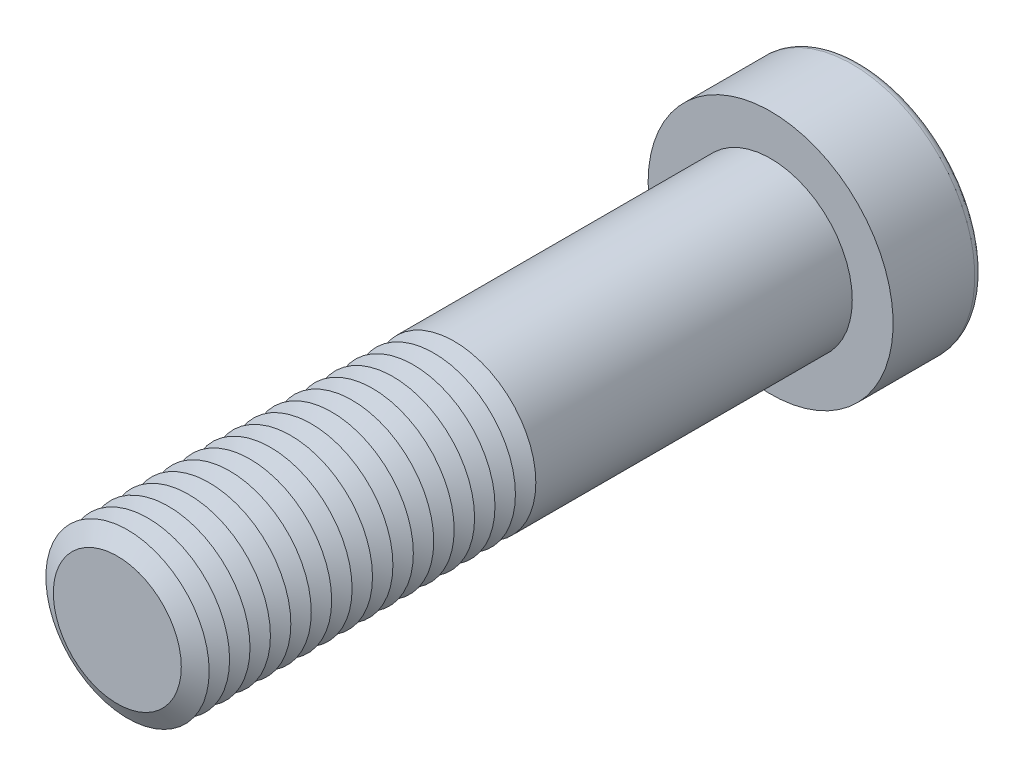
from build123d import *

# Parameters (mm, degrees)
SKETCH1_R           = 10
BOSS_EXTRUDE1_DEPTH = 80
SKETCH2_R           = 15
BOSS_EXTRUDE2_DEPTH = 11
CUT_EXTRUDE1_DEPTH  = 10.5
FILLET1_R           = 1
LPATTERN1_COUNT     = 17
LPATTERN1_PITCH     = 2.5


with BuildPart() as part:
    # Sketch1 → Boss-Extrude1 (new body)
    with BuildSketch(Plane.XY):
        Circle(SKETCH1_R)
    extrude(amount=BOSS_EXTRUDE1_DEPTH)

    # Sketch2 → Boss-Extrude2 (add)
    with BuildSketch(Plane(origin=(0, 0, 0), x_dir=(-1, 0, 0), z_dir=(0, 0, -1))):
        Circle(SKETCH2_R)
    extrude(amount=BOSS_EXTRUDE2_DEPTH)

    # Sketch3 → Cut-Extrude1 (cut)
    with BuildSketch(Plane(origin=(0, 0, -11), x_dir=(-1, 0, 0), z_dir=(0, 0, -1))):
        Polygon((-4.041451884, 7), (-8.082903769, 0), (-4.041451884, -7), (4.041451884, -7), (8.082903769, 0), (4.041451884, 7), align=None)
    extrude(amount=-CUT_EXTRUDE1_DEPTH, mode=Mode.SUBTRACT)

    # Fillet1
    fillet1_edges = [part.edges().sort_by_distance(p)[0] for p in [
        (15, 0, -11),
    ]]
    fillet(fillet1_edges, radius=FILLET1_R)

    # Cut-Extrude2 cone 1 section (on through the dimple's axis) → Cut-Extrude2 (revolve, cut)
    with BuildSketch(Plane(origin=(0, 0, -0.5), x_dir=(0, 1, 0), z_dir=(1, 0, 0))):
        Polygon((0, 0), (7, 0), (0, 4.041451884), align=None)
    revolve(axis=Axis((0, 0, -0.5), (0, 0, 1)), mode=Mode.SUBTRACT)

    # Cut-Extrude3 cone 1 section (on through the dimple's axis) → Cut-Extrude3 (revolve, cut)
    with BuildSketch(Plane(origin=(0, 0, -11), x_dir=(0, 1, 0), z_dir=(1, 0, 0))):
        Polygon((0, 0), (8.082903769, 0), (0, 2.165807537), align=None)
    revolve(axis=Axis((0, 0, -11), (0, 0, 1)), mode=Mode.SUBTRACT)

    # Sketch7 → Cut-Revolve1 (revolve, cut)
    with BuildSketch(Plane(origin=(0, 0, 0), x_dir=(0, 0, -1), z_dir=(1, 0, 0)), mode=Mode.PRIVATE) as cut_revolve1_sk:
        Polygon((-80, 7.834936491), (-78.75, 10), (-81.25, 10), align=None)
    cut_revolve1 = revolve(cut_revolve1_sk.sketch.rotate(Axis((0, 0, 80), (0, 0, -1)), 90), axis=Axis((0, 0, 80), (0, 0, -1)), mode=Mode.SUBTRACT)

    # LPattern1: Cut-Revolve1 ×17
    with Locations(*[(0, 0, -i * LPATTERN1_PITCH) for i in range(1, LPATTERN1_COUNT)]):
        add(cut_revolve1, mode=Mode.SUBTRACT)


solid = part.part
